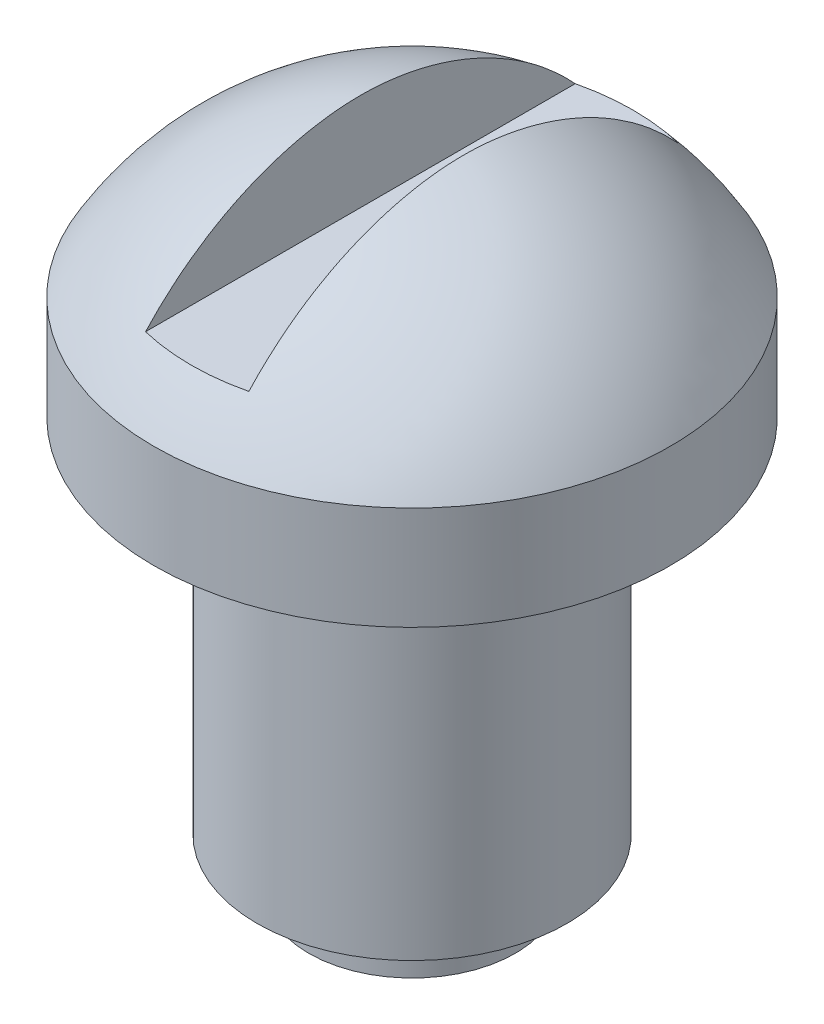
ISO-10303-21;
HEADER;
FILE_DESCRIPTION(('STEP AP214'),'2;1');
FILE_NAME('part.step','',(''),(''),'','','');
FILE_SCHEMA(('AUTOMOTIVE_DESIGN { 1 0 10303 214 1 1 1 1 }'));
ENDSEC;
DATA;
#1=APPLICATION_CONTEXT('core data for automotive mechanical design processes');
#2=APPLICATION_PROTOCOL_DEFINITION('international standard','automotive_design',2000,#1);
#3=PRODUCT_CONTEXT('',#1,'mechanical');
#4=PRODUCT('Part','Part','',(#3));
#5=PRODUCT_RELATED_PRODUCT_CATEGORY('part','',(#4));
#6=PRODUCT_DEFINITION_FORMATION('','',#4);
#7=PRODUCT_DEFINITION_CONTEXT('part definition',#1,'design');
#8=PRODUCT_DEFINITION('design','',#6,#7);
#9=PRODUCT_DEFINITION_SHAPE('','',#8);
#10=(LENGTH_UNIT() NAMED_UNIT(*) SI_UNIT(.MILLI.,.METRE.));
#11=(NAMED_UNIT(*) PLANE_ANGLE_UNIT() SI_UNIT($,.RADIAN.));
#12=(NAMED_UNIT(*) SI_UNIT($,.STERADIAN.) SOLID_ANGLE_UNIT());
#13=UNCERTAINTY_MEASURE_WITH_UNIT(LENGTH_MEASURE(1.E-05),#10,'distance_accuracy_value','');
#14=(GEOMETRIC_REPRESENTATION_CONTEXT(3) GLOBAL_UNCERTAINTY_ASSIGNED_CONTEXT((#13)) GLOBAL_UNIT_ASSIGNED_CONTEXT((#10,
#11,#12)) REPRESENTATION_CONTEXT('',''));
#15=CARTESIAN_POINT('',(0.,0.,0.));
#16=DIRECTION('',(0.,0.,1.));
#17=DIRECTION('',(1.,0.,0.));
#18=AXIS2_PLACEMENT_3D('',#15,#16,#17);
#19=CARTESIAN_POINT('',(1.59397495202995E-09,7.00326915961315,0.));
#20=DIRECTION('',(0.,1.,0.));
#21=DIRECTION('',(0.,0.,1.));
#22=AXIS2_PLACEMENT_3D('',#19,#20,#21);
#23=DEGENERATE_TOROIDAL_SURFACE('',#22,0.198038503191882,6.,.F.);
#24=CARTESIAN_POINT('',(1.59397495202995E-09,10.9999999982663,0.));
#25=DIRECTION('',(0.,-1.,0.));
#26=DIRECTION('',(0.,0.,-1.));
#27=AXIS2_PLACEMENT_3D('',#24,#25,#26);
#28=CIRCLE('',#27,4.27701932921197);
#29=CARTESIAN_POINT('',(-0.999999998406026,10.9999999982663,-4.15847259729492));
#30=VERTEX_POINT('',#29);
#31=CARTESIAN_POINT('',(1.00000000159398,10.9999999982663,-4.15847259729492));
#32=VERTEX_POINT('',#31);
#33=EDGE_CURVE('E68',#30,#32,#28,.T.);
#34=ORIENTED_EDGE('',*,*,#33,.T.);
#35=CARTESIAN_POINT('',(1.00000000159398,12.8824445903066,0.));
#36=CARTESIAN_POINT('',(1.00000000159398,12.8824444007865,0.0847152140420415));
#37=CARTESIAN_POINT('',(1.00000000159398,12.8802443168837,0.169431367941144));
#38=CARTESIAN_POINT('',(1.00000000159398,12.8715212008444,0.33863564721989));
#39=CARTESIAN_POINT('',(1.00000000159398,12.864997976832,0.423123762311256));
#40=CARTESIAN_POINT('',(1.00000000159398,12.8392041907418,0.676049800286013));
#41=CARTESIAN_POINT('',(1.00000000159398,12.8137097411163,0.843886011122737));
#42=CARTESIAN_POINT('',(1.00000000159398,12.7493007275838,1.16718626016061));
#43=CARTESIAN_POINT('',(1.00000000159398,12.7112135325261,1.32281841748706));
#44=CARTESIAN_POINT('',(1.00000000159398,12.622126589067,1.630368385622));
#45=CARTESIAN_POINT('',(1.00000000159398,12.5711218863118,1.78228474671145));
#46=CARTESIAN_POINT('',(1.00000000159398,12.3993728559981,2.23126062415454));
#47=CARTESIAN_POINT('',(1.00000000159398,12.2599232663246,2.52140116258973));
#48=CARTESIAN_POINT('',(1.00000000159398,11.9339477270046,3.07783725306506));
#49=CARTESIAN_POINT('',(1.00000000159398,11.74693953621,3.3438481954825));
#50=CARTESIAN_POINT('',(1.00000000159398,11.3318605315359,3.84147886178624));
#51=CARTESIAN_POINT('',(1.00000000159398,11.1038069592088,4.0731129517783));
#52=CARTESIAN_POINT('',(1.00000000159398,10.6073283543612,4.50058698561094));
#53=CARTESIAN_POINT('',(1.00000000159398,10.3381163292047,4.69551335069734));
#54=CARTESIAN_POINT('',(1.00000000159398,9.7707977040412,5.03757140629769));
#55=CARTESIAN_POINT('',(1.00000000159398,9.47268567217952,5.18469408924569));
#56=CARTESIAN_POINT('',(1.00000000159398,8.85530329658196,5.42727476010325));
#57=CARTESIAN_POINT('',(1.00000000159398,8.53598121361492,5.52260078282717));
#58=CARTESIAN_POINT('',(1.00000000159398,7.88570514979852,5.65830273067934));
#59=CARTESIAN_POINT('',(1.00000000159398,7.55475170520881,5.69868118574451));
#60=CARTESIAN_POINT('',(1.00000000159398,7.0569891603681,5.71723650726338));
#61=CARTESIAN_POINT('',(1.00000000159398,6.89070763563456,5.71640136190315));
#62=CARTESIAN_POINT('',(1.00000000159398,6.55882164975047,5.70073557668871));
#63=CARTESIAN_POINT('',(1.00000000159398,6.39321696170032,5.68591009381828));
#64=CARTESIAN_POINT('',(1.00000000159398,6.06378661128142,5.64235342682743));
#65=CARTESIAN_POINT('',(1.00000000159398,5.89996173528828,5.61361633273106));
#66=CARTESIAN_POINT('',(1.00000000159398,5.57537265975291,5.54245436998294));
#67=CARTESIAN_POINT('',(1.00000000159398,5.41460735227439,5.50003456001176));
#68=CARTESIAN_POINT('',(1.00000000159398,5.09714777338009,5.40178062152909));
#69=CARTESIAN_POINT('',(1.00000000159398,4.94045544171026,5.34594022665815));
#70=CARTESIAN_POINT('',(1.00000000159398,4.6323914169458,5.22127480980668));
#71=CARTESIAN_POINT('',(1.00000000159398,4.4810177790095,5.15245459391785));
#72=CARTESIAN_POINT('',(1.00000000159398,4.1845729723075,5.00228575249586));
#73=CARTESIAN_POINT('',(1.00000000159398,4.03950329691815,4.9209341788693));
#74=CARTESIAN_POINT('',(1.00000000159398,3.75679081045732,4.7463232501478));
#75=CARTESIAN_POINT('',(1.00000000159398,3.61914526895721,4.65306831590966));
#76=CARTESIAN_POINT('',(1.00000000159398,3.35221521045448,4.45529471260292));
#77=CARTESIAN_POINT('',(1.00000000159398,3.22293005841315,4.35077690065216));
#78=CARTESIAN_POINT('',(1.00000000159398,2.97368009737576,4.13125199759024));
#79=CARTESIAN_POINT('',(1.00000000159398,2.85371184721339,4.01624881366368));
#80=CARTESIAN_POINT('',(1.00000000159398,2.62382717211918,3.7764534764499));
#81=CARTESIAN_POINT('',(1.00000000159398,2.51391744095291,3.65165490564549));
#82=CARTESIAN_POINT('',(1.00000000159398,2.3050737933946,3.39326595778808));
#83=CARTESIAN_POINT('',(1.00000000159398,2.20613578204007,3.25967889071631));
#84=CARTESIAN_POINT('',(1.00000000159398,2.02003412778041,2.98479173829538));
#85=CARTESIAN_POINT('',(1.00000000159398,1.93285544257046,2.8435018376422));
#86=CARTESIAN_POINT('',(1.00000000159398,1.77080927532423,2.55409979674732));
#87=CARTESIAN_POINT('',(1.00000000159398,1.69593708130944,2.4059902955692));
#88=CARTESIAN_POINT('',(1.00000000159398,1.55905222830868,2.10391433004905));
#89=CARTESIAN_POINT('',(1.00000000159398,1.49704151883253,1.94994698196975));
#90=CARTESIAN_POINT('',(1.00000000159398,1.38646037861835,1.63722122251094));
#91=CARTESIAN_POINT('',(1.00000000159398,1.33789225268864,1.47846199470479));
#92=CARTESIAN_POINT('',(1.00000000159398,1.25519800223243,1.15867481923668));
#93=CARTESIAN_POINT('',(1.00000000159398,1.22095170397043,0.997677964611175));
#94=CARTESIAN_POINT('',(1.00000000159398,1.16720809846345,0.673232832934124));
#95=CARTESIAN_POINT('',(1.00000000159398,1.14770610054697,0.509785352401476));
#96=CARTESIAN_POINT('',(1.00000000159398,1.13050305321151,0.26390234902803));
#97=CARTESIAN_POINT('',(1.00000000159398,1.12677602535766,0.18185887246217));
#98=CARTESIAN_POINT('',(1.00000000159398,1.12343933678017,0.0176888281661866));
#99=CARTESIAN_POINT('',(1.00000000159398,1.12382963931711,-0.0644377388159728));
#100=CARTESIAN_POINT('',(1.00000000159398,1.13117783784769,-0.310631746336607));
#101=CARTESIAN_POINT('',(1.00000000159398,1.14431037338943,-0.474551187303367));
#102=CARTESIAN_POINT('',(1.00000000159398,1.18344980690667,-0.781882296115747));
#103=CARTESIAN_POINT('',(1.00000000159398,1.20782746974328,-0.925511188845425));
#104=CARTESIAN_POINT('',(1.00000000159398,1.26775213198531,-1.21041404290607));
#105=CARTESIAN_POINT('',(1.00000000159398,1.30329866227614,-1.35168810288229));
#106=CARTESIAN_POINT('',(1.00000000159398,1.38511184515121,-1.63129077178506));
#107=CARTESIAN_POINT('',(1.00000000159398,1.43139251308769,-1.769615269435));
#108=CARTESIAN_POINT('',(1.00000000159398,1.5342345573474,-2.04238346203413));
#109=CARTESIAN_POINT('',(1.00000000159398,1.59079595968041,-2.17682714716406));
#110=CARTESIAN_POINT('',(1.00000000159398,1.71932361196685,-2.45295167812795));
#111=CARTESIAN_POINT('',(1.00000000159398,1.79221580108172,-2.59420244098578));
#112=CARTESIAN_POINT('',(1.00000000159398,1.94924069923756,-2.87037584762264));
#113=CARTESIAN_POINT('',(1.00000000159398,2.03337758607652,-3.00529611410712));
#114=CARTESIAN_POINT('',(1.00000000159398,2.21221225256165,-3.26776765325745));
#115=CARTESIAN_POINT('',(1.00000000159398,2.30690040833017,-3.39532548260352));
#116=CARTESIAN_POINT('',(1.00000000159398,2.50630018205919,-3.64242532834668));
#117=CARTESIAN_POINT('',(1.00000000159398,2.61101549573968,-3.76196436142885));
#118=CARTESIAN_POINT('',(1.00000000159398,2.83416038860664,-3.99684693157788));
#119=CARTESIAN_POINT('',(1.00000000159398,2.95297255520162,-4.11182732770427));
#120=CARTESIAN_POINT('',(1.00000000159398,3.19986737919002,-4.33145883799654));
#121=CARTESIAN_POINT('',(1.00000000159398,3.32795355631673,-4.43610599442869));
#122=CARTESIAN_POINT('',(1.00000000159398,3.59245187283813,-4.63429076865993));
#123=CARTESIAN_POINT('',(1.00000000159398,3.72886406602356,-4.72782831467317));
#124=CARTESIAN_POINT('',(1.00000000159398,4.00910184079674,-4.90316978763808));
#125=CARTESIAN_POINT('',(1.00000000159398,4.1529301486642,-4.98496935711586));
#126=CARTESIAN_POINT('',(1.00000000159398,4.44750752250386,-5.13651256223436));
#127=CARTESIAN_POINT('',(1.00000000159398,4.59828117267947,-5.20620841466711));
#128=CARTESIAN_POINT('',(1.00000000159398,4.90521575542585,-5.33268683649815));
#129=CARTESIAN_POINT('',(1.00000000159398,5.06137865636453,-5.38946462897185));
#130=CARTESIAN_POINT('',(1.00000000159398,5.37785718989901,-5.48964948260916));
#131=CARTESIAN_POINT('',(1.00000000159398,5.5381708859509,-5.53306266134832));
#132=CARTESIAN_POINT('',(1.00000000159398,5.86193882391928,-5.60625938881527));
#133=CARTESIAN_POINT('',(1.00000000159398,6.0253941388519,-5.63603819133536));
#134=CARTESIAN_POINT('',(1.00000000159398,6.3543587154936,-5.68175099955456));
#135=CARTESIAN_POINT('',(1.00000000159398,6.51986947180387,-5.69767425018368));
#136=CARTESIAN_POINT('',(1.00000000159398,6.85164404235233,-5.71552388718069));
#137=CARTESIAN_POINT('',(1.00000000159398,7.0179078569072,-5.71745026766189));
#138=CARTESIAN_POINT('',(1.00000000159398,7.3500389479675,-5.70729151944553));
#139=CARTESIAN_POINT('',(1.00000000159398,7.51590614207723,-5.69520369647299));
#140=CARTESIAN_POINT('',(1.00000000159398,7.84597510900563,-5.65710445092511));
#141=CARTESIAN_POINT('',(1.00000000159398,8.01017744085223,-5.63109787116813));
#142=CARTESIAN_POINT('',(1.00000000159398,8.33588954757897,-5.5653319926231));
#143=CARTESIAN_POINT('',(1.00000000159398,8.49739794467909,-5.52556586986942));
#144=CARTESIAN_POINT('',(1.00000000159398,8.81643061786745,-5.4325826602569));
#145=CARTESIAN_POINT('',(1.00000000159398,8.97395633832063,-5.379370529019));
#146=CARTESIAN_POINT('',(1.00000000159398,9.28403226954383,-5.25983909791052));
#147=CARTESIAN_POINT('',(1.00000000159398,9.43658029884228,-5.19351413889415));
#148=CARTESIAN_POINT('',(1.00000000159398,9.73548754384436,-5.04826866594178));
#149=CARTESIAN_POINT('',(1.00000000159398,9.88184902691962,-4.96935281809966));
#150=CARTESIAN_POINT('',(1.00000000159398,10.167439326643,-4.79944382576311));
#151=CARTESIAN_POINT('',(1.00000000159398,10.3066661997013,-4.70844741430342));
#152=CARTESIAN_POINT('',(1.00000000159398,10.5769008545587,-4.5150743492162));
#153=CARTESIAN_POINT('',(1.00000000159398,10.7079116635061,-4.41270192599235));
#154=CARTESIAN_POINT('',(1.00000000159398,10.9608430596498,-4.19726618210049));
#155=CARTESIAN_POINT('',(1.00000000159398,11.0827630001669,-4.08420210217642));
#156=CARTESIAN_POINT('',(1.00000000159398,11.3165839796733,-3.8482330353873));
#157=CARTESIAN_POINT('',(1.00000000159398,11.4284887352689,-3.72533173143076));
#158=CARTESIAN_POINT('',(1.00000000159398,11.6414066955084,-3.4706586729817));
#159=CARTESIAN_POINT('',(1.00000000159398,11.7424316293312,-3.33889672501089));
#160=CARTESIAN_POINT('',(1.00000000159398,11.9329571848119,-3.06736210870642));
#161=CARTESIAN_POINT('',(1.00000000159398,12.0224621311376,-2.92759247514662));
#162=CARTESIAN_POINT('',(1.00000000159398,12.1894449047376,-2.64077164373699));
#163=CARTESIAN_POINT('',(1.00000000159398,12.2669051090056,-2.49371018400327));
#164=CARTESIAN_POINT('',(1.00000000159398,12.4090278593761,-2.19353250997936));
#165=CARTESIAN_POINT('',(1.00000000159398,12.4736909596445,-2.04041655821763));
#166=CARTESIAN_POINT('',(1.00000000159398,12.587826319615,-1.73407724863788));
#167=CARTESIAN_POINT('',(1.00000000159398,12.6377111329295,-1.58100763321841));
#168=CARTESIAN_POINT('',(1.00000000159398,12.7243849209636,-1.27117461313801));
#169=CARTESIAN_POINT('',(1.00000000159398,12.7611717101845,-1.11441059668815));
#170=CARTESIAN_POINT('',(1.00000000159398,12.8208024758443,-0.798698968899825));
#171=CARTESIAN_POINT('',(1.00000000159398,12.8436887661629,-0.639759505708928));
#172=CARTESIAN_POINT('',(1.00000000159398,12.8668198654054,-0.400349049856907));
#173=CARTESIAN_POINT('',(1.00000000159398,12.8726638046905,-0.32039092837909));
#174=CARTESIAN_POINT('',(1.00000000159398,12.8804760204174,-0.1602888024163));
#175=CARTESIAN_POINT('',(1.00000000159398,12.8824447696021,-0.0801448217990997));
#176=CARTESIAN_POINT('',(1.00000000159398,12.8824445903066,0.));
#177=B_SPLINE_CURVE_WITH_KNOTS('',3,(#35,#36,#37,#38,#39,#40,#41,#42,#43,#44,#45,#46,#47,#48,
#49,#50,#51,#52,#53,#54,#55,#56,#57,#58,#59,#60,#61,#62,#63,#64,#65,#66,#67,#68,#69,#70,#71,#72,
#73,#74,#75,#76,#77,#78,#79,#80,#81,#82,#83,#84,#85,#86,#87,#88,#89,#90,#91,#92,#93,#94,#95,#96,
#97,#98,#99,#100,#101,#102,#103,#104,#105,#106,#107,#108,#109,#110,#111,#112,#113,#114,#115,
#116,#117,#118,#119,#120,#121,#122,#123,#124,#125,#126,#127,#128,#129,#130,#131,#132,#133,#134,
#135,#136,#137,#138,#139,#140,#141,#142,#143,#144,#145,#146,#147,#148,#149,#150,#151,#152,#153,
#154,#155,#156,#157,#158,#159,#160,#161,#162,#163,#164,#165,#166,#167,#168,#169,#170,#171,#172,
#173,#174,#175,#176),.UNSPECIFIED.,.T.,.F.,(4,2,2,2,2,2,2,2,2,2,2,2,2,2,2,2,2,2,2,2,2,2,2,2,2,2,
2,2,2,2,2,2,2,2,2,2,2,2,2,2,2,2,2,2,2,2,2,2,2,2,2,2,2,2,2,2,2,2,2,2,2,2,2,2,2,2,2,2,2,2,4),(0.,
0.254116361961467,0.508244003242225,1.01668865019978,1.49678878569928,1.9770733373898,
2.93808324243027,3.90925590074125,4.88002155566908,5.87243907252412,6.86504348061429,
7.86016508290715,8.85524086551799,9.35360700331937,9.8517895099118,10.3501838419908,
10.8483941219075,11.3468374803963,11.845096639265,12.3434731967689,12.8416651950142,
13.3398193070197,13.8377885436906,14.3360867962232,14.8341984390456,15.3316667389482,
15.8289441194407,16.3262968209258,16.8237347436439,17.3169106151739,17.8099295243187,
18.0562229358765,18.3025141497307,18.7949837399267,19.2315947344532,19.6681873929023,
20.1053533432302,20.5425203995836,21.0188367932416,21.495330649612,21.9713933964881,
22.4476322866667,22.9430608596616,23.4386784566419,23.9342992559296,24.4301035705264,
24.927822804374,25.425725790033,25.9234005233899,26.421248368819,26.9194823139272,
27.4177164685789,27.9160464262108,28.4142031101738,28.9126072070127,29.4108278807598,
29.9092640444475,30.4075159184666,30.9059028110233,31.4041049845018,31.902342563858,
32.4003944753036,32.8979039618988,33.395226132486,33.8932692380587,34.3912907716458,
34.8737050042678,35.3561996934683,35.8372181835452,36.0776542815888,36.3180610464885),.UNSPECIFIED.);
#178=CARTESIAN_POINT('',(1.00000000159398,10.9999999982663,4.15847259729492));
#179=VERTEX_POINT('',#178);
#180=EDGE_CURVE('E11',#32,#179,#177,.T.);
#181=ORIENTED_EDGE('',*,*,#180,.T.);
#182=CARTESIAN_POINT('',(-0.999999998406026,10.9999999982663,4.15847259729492));
#183=VERTEX_POINT('',#182);
#184=EDGE_CURVE('E45',#179,#183,#28,.T.);
#185=ORIENTED_EDGE('',*,*,#184,.T.);
#186=CARTESIAN_POINT('',(-0.999999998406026,12.8824445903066,0.));
#187=CARTESIAN_POINT('',(-0.999999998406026,12.8824444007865,-0.0847152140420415));
#188=CARTESIAN_POINT('',(-0.999999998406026,12.8802443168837,-0.169431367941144));
#189=CARTESIAN_POINT('',(-0.999999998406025,12.8715212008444,-0.33863564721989));
#190=CARTESIAN_POINT('',(-0.999999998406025,12.864997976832,-0.423123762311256));
#191=CARTESIAN_POINT('',(-0.999999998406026,12.8392041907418,-0.676049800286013));
#192=CARTESIAN_POINT('',(-0.999999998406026,12.8137097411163,-0.843886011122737));
#193=CARTESIAN_POINT('',(-0.999999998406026,12.7493007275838,-1.16718626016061));
#194=CARTESIAN_POINT('',(-0.999999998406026,12.7112135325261,-1.32281841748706));
#195=CARTESIAN_POINT('',(-0.999999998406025,12.622126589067,-1.630368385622));
#196=CARTESIAN_POINT('',(-0.999999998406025,12.5711218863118,-1.78228474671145));
#197=CARTESIAN_POINT('',(-0.999999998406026,12.3993728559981,-2.23126062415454));
#198=CARTESIAN_POINT('',(-0.999999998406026,12.2599232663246,-2.52140116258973));
#199=CARTESIAN_POINT('',(-0.999999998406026,11.9339477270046,-3.07783725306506));
#200=CARTESIAN_POINT('',(-0.999999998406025,11.74693953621,-3.3438481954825));
#201=CARTESIAN_POINT('',(-0.999999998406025,11.3318605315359,-3.84147886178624));
#202=CARTESIAN_POINT('',(-0.999999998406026,11.1038069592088,-4.0731129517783));
#203=CARTESIAN_POINT('',(-0.999999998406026,10.6073283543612,-4.50058698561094));
#204=CARTESIAN_POINT('',(-0.999999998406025,10.3381163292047,-4.69551335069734));
#205=CARTESIAN_POINT('',(-0.999999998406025,9.7707977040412,-5.03757140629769));
#206=CARTESIAN_POINT('',(-0.999999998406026,9.47268567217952,-5.18469408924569));
#207=CARTESIAN_POINT('',(-0.999999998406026,8.85530329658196,-5.42727476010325));
#208=CARTESIAN_POINT('',(-0.999999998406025,8.53598121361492,-5.52260078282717));
#209=CARTESIAN_POINT('',(-0.999999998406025,7.88570514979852,-5.65830273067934));
#210=CARTESIAN_POINT('',(-0.999999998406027,7.55475170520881,-5.69868118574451));
#211=CARTESIAN_POINT('',(-0.999999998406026,7.0569891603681,-5.71723650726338));
#212=CARTESIAN_POINT('',(-0.999999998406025,6.89070763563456,-5.71640136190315));
#213=CARTESIAN_POINT('',(-0.999999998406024,6.55882164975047,-5.70073557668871));
#214=CARTESIAN_POINT('',(-0.999999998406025,6.39321696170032,-5.68591009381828));
#215=CARTESIAN_POINT('',(-0.999999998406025,6.06378661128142,-5.64235342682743));
#216=CARTESIAN_POINT('',(-0.999999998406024,5.89996173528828,-5.61361633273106));
#217=CARTESIAN_POINT('',(-0.999999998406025,5.57537265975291,-5.54245436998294));
#218=CARTESIAN_POINT('',(-0.999999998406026,5.41460735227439,-5.50003456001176));
#219=CARTESIAN_POINT('',(-0.999999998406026,5.09714777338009,-5.40178062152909));
#220=CARTESIAN_POINT('',(-0.999999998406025,4.94045544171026,-5.34594022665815));
#221=CARTESIAN_POINT('',(-0.999999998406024,4.6323914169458,-5.22127480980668));
#222=CARTESIAN_POINT('',(-0.999999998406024,4.4810177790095,-5.15245459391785));
#223=CARTESIAN_POINT('',(-0.999999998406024,4.1845729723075,-5.00228575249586));
#224=CARTESIAN_POINT('',(-0.999999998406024,4.03950329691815,-4.9209341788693));
#225=CARTESIAN_POINT('',(-0.999999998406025,3.75679081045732,-4.74632325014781));
#226=CARTESIAN_POINT('',(-0.999999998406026,3.61914526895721,-4.65306831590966));
#227=CARTESIAN_POINT('',(-0.999999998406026,3.35221521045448,-4.45529471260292));
#228=CARTESIAN_POINT('',(-0.999999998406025,3.22293005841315,-4.35077690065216));
#229=CARTESIAN_POINT('',(-0.999999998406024,2.97368009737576,-4.13125199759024));
#230=CARTESIAN_POINT('',(-0.999999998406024,2.85371184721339,-4.01624881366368));
#231=CARTESIAN_POINT('',(-0.999999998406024,2.62382717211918,-3.7764534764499));
#232=CARTESIAN_POINT('',(-0.999999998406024,2.51391744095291,-3.65165490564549));
#233=CARTESIAN_POINT('',(-0.999999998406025,2.3050737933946,-3.39326595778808));
#234=CARTESIAN_POINT('',(-0.999999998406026,2.20613578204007,-3.25967889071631));
#235=CARTESIAN_POINT('',(-0.999999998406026,2.02003412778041,-2.98479173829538));
#236=CARTESIAN_POINT('',(-0.999999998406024,1.93285544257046,-2.8435018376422));
#237=CARTESIAN_POINT('',(-0.999999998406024,1.77080927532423,-2.55409979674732));
#238=CARTESIAN_POINT('',(-0.999999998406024,1.69593708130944,-2.4059902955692));
#239=CARTESIAN_POINT('',(-0.999999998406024,1.55905222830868,-2.10391433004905));
#240=CARTESIAN_POINT('',(-0.999999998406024,1.49704151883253,-1.94994698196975));
#241=CARTESIAN_POINT('',(-0.999999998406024,1.38646037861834,-1.63722122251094));
#242=CARTESIAN_POINT('',(-0.999999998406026,1.33789225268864,-1.47846199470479));
#243=CARTESIAN_POINT('',(-0.999999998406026,1.25519800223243,-1.15867481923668));
#244=CARTESIAN_POINT('',(-0.999999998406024,1.22095170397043,-0.997677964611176));
#245=CARTESIAN_POINT('',(-0.999999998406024,1.16720809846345,-0.673232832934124));
#246=CARTESIAN_POINT('',(-0.999999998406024,1.14770610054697,-0.509785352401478));
#247=CARTESIAN_POINT('',(-0.999999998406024,1.13050305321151,-0.263902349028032));
#248=CARTESIAN_POINT('',(-0.999999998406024,1.12677602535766,-0.181858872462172));
#249=CARTESIAN_POINT('',(-0.999999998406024,1.12343933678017,-0.0176888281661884));
#250=CARTESIAN_POINT('',(-0.999999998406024,1.12382963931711,0.0644377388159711));
#251=CARTESIAN_POINT('',(-0.999999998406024,1.13117783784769,0.310631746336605));
#252=CARTESIAN_POINT('',(-0.999999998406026,1.14431037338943,0.474551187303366));
#253=CARTESIAN_POINT('',(-0.999999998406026,1.18344980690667,0.781882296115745));
#254=CARTESIAN_POINT('',(-0.999999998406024,1.20782746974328,0.925511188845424));
#255=CARTESIAN_POINT('',(-0.999999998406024,1.26775213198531,1.21041404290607));
#256=CARTESIAN_POINT('',(-0.999999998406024,1.30329866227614,1.35168810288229));
#257=CARTESIAN_POINT('',(-0.999999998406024,1.38511184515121,1.63129077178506));
#258=CARTESIAN_POINT('',(-0.999999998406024,1.43139251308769,1.76961526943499));
#259=CARTESIAN_POINT('',(-0.999999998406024,1.5342345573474,2.04238346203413));
#260=CARTESIAN_POINT('',(-0.999999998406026,1.59079595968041,2.17682714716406));
#261=CARTESIAN_POINT('',(-0.999999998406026,1.71932361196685,2.45295167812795));
#262=CARTESIAN_POINT('',(-0.999999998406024,1.79221580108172,2.59420244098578));
#263=CARTESIAN_POINT('',(-0.999999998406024,1.94924069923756,2.87037584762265));
#264=CARTESIAN_POINT('',(-0.999999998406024,2.03337758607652,3.00529611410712));
#265=CARTESIAN_POINT('',(-0.999999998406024,2.21221225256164,3.26776765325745));
#266=CARTESIAN_POINT('',(-0.999999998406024,2.30690040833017,3.39532548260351));
#267=CARTESIAN_POINT('',(-0.999999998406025,2.50630018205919,3.64242532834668));
#268=CARTESIAN_POINT('',(-0.999999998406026,2.61101549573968,3.76196436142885));
#269=CARTESIAN_POINT('',(-0.999999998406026,2.83416038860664,3.99684693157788));
#270=CARTESIAN_POINT('',(-0.999999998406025,2.95297255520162,4.11182732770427));
#271=CARTESIAN_POINT('',(-0.999999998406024,3.19986737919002,4.33145883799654));
#272=CARTESIAN_POINT('',(-0.999999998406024,3.32795355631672,4.43610599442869));
#273=CARTESIAN_POINT('',(-0.999999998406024,3.59245187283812,4.63429076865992));
#274=CARTESIAN_POINT('',(-0.999999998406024,3.72886406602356,4.72782831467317));
#275=CARTESIAN_POINT('',(-0.999999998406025,4.00910184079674,4.90316978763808));
#276=CARTESIAN_POINT('',(-0.999999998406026,4.1529301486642,4.98496935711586));
#277=CARTESIAN_POINT('',(-0.999999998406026,4.44750752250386,5.13651256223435));
#278=CARTESIAN_POINT('',(-0.999999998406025,4.59828117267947,5.20620841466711));
#279=CARTESIAN_POINT('',(-0.999999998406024,4.90521575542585,5.33268683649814));
#280=CARTESIAN_POINT('',(-0.999999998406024,5.06137865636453,5.38946462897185));
#281=CARTESIAN_POINT('',(-0.999999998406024,5.37785718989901,5.48964948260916));
#282=CARTESIAN_POINT('',(-0.999999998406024,5.5381708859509,5.53306266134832));
#283=CARTESIAN_POINT('',(-0.999999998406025,5.86193882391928,5.60625938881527));
#284=CARTESIAN_POINT('',(-0.999999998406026,6.0253941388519,5.63603819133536));
#285=CARTESIAN_POINT('',(-0.999999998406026,6.3543587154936,5.68175099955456));
#286=CARTESIAN_POINT('',(-0.999999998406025,6.51986947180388,5.69767425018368));
#287=CARTESIAN_POINT('',(-0.999999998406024,6.85164404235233,5.71552388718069));
#288=CARTESIAN_POINT('',(-0.999999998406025,7.0179078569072,5.71745026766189));
#289=CARTESIAN_POINT('',(-0.999999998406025,7.3500389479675,5.70729151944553));
#290=CARTESIAN_POINT('',(-0.999999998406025,7.51590614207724,5.69520369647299));
#291=CARTESIAN_POINT('',(-0.999999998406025,7.84597510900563,5.65710445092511));
#292=CARTESIAN_POINT('',(-0.999999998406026,8.01017744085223,5.63109787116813));
#293=CARTESIAN_POINT('',(-0.999999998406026,8.33588954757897,5.56533199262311));
#294=CARTESIAN_POINT('',(-0.999999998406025,8.49739794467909,5.52556586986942));
#295=CARTESIAN_POINT('',(-0.999999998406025,8.81643061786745,5.4325826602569));
#296=CARTESIAN_POINT('',(-0.999999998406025,8.97395633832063,5.379370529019));
#297=CARTESIAN_POINT('',(-0.999999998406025,9.28403226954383,5.25983909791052));
#298=CARTESIAN_POINT('',(-0.999999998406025,9.43658029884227,5.19351413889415));
#299=CARTESIAN_POINT('',(-0.999999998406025,9.73548754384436,5.04826866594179));
#300=CARTESIAN_POINT('',(-0.999999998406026,9.88184902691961,4.96935281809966));
#301=CARTESIAN_POINT('',(-0.999999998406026,10.167439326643,4.79944382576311));
#302=CARTESIAN_POINT('',(-0.999999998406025,10.3066661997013,4.70844741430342));
#303=CARTESIAN_POINT('',(-0.999999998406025,10.5769008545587,4.5150743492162));
#304=CARTESIAN_POINT('',(-0.999999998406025,10.7079116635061,4.41270192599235));
#305=CARTESIAN_POINT('',(-0.999999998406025,10.9608430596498,4.19726618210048));
#306=CARTESIAN_POINT('',(-0.999999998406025,11.0827630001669,4.08420210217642));
#307=CARTESIAN_POINT('',(-0.999999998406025,11.3165839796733,3.8482330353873));
#308=CARTESIAN_POINT('',(-0.999999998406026,11.4284887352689,3.72533173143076));
#309=CARTESIAN_POINT('',(-0.999999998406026,11.6414066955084,3.4706586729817));
#310=CARTESIAN_POINT('',(-0.999999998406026,11.7424316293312,3.33889672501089));
#311=CARTESIAN_POINT('',(-0.999999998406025,11.9329571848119,3.06736210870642));
#312=CARTESIAN_POINT('',(-0.999999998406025,12.0224621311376,2.92759247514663));
#313=CARTESIAN_POINT('',(-0.999999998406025,12.1894449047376,2.64077164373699));
#314=CARTESIAN_POINT('',(-0.999999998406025,12.2669051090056,2.49371018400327));
#315=CARTESIAN_POINT('',(-0.999999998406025,12.4090278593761,2.19353250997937));
#316=CARTESIAN_POINT('',(-0.999999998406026,12.4736909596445,2.04041655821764));
#317=CARTESIAN_POINT('',(-0.999999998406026,12.587826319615,1.73407724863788));
#318=CARTESIAN_POINT('',(-0.999999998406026,12.6377111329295,1.58100763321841));
#319=CARTESIAN_POINT('',(-0.999999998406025,12.7243849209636,1.27117461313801));
#320=CARTESIAN_POINT('',(-0.999999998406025,12.7611717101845,1.11441059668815));
#321=CARTESIAN_POINT('',(-0.999999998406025,12.8208024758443,0.798698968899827));
#322=CARTESIAN_POINT('',(-0.999999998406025,12.8436887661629,0.639759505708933));
#323=CARTESIAN_POINT('',(-0.999999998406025,12.8668198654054,0.400349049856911));
#324=CARTESIAN_POINT('',(-0.999999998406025,12.8726638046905,0.320390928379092));
#325=CARTESIAN_POINT('',(-0.999999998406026,12.8804760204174,0.1602888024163));
#326=CARTESIAN_POINT('',(-0.999999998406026,12.8824447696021,0.0801448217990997));
#327=CARTESIAN_POINT('',(-0.999999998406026,12.8824445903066,0.));
#328=B_SPLINE_CURVE_WITH_KNOTS('',3,(#186,#187,#188,#189,#190,#191,#192,#193,#194,#195,#196,
#197,#198,#199,#200,#201,#202,#203,#204,#205,#206,#207,#208,#209,#210,#211,#212,#213,#214,#215,
#216,#217,#218,#219,#220,#221,#222,#223,#224,#225,#226,#227,#228,#229,#230,#231,#232,#233,#234,
#235,#236,#237,#238,#239,#240,#241,#242,#243,#244,#245,#246,#247,#248,#249,#250,#251,#252,#253,
#254,#255,#256,#257,#258,#259,#260,#261,#262,#263,#264,#265,#266,#267,#268,#269,#270,#271,#272,
#273,#274,#275,#276,#277,#278,#279,#280,#281,#282,#283,#284,#285,#286,#287,#288,#289,#290,#291,
#292,#293,#294,#295,#296,#297,#298,#299,#300,#301,#302,#303,#304,#305,#306,#307,#308,#309,#310,
#311,#312,#313,#314,#315,#316,#317,#318,#319,#320,#321,#322,#323,#324,#325,#326,#327),
.UNSPECIFIED.,.T.,.F.,(4,2,2,2,2,2,2,2,2,2,2,2,2,2,2,2,2,2,2,2,2,2,2,2,2,2,2,2,2,2,2,2,2,2,2,2,
2,2,2,2,2,2,2,2,2,2,2,2,2,2,2,2,2,2,2,2,2,2,2,2,2,2,2,2,2,2,2,2,2,2,4),(0.,0.254116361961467,
0.508244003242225,1.01668865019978,1.49678878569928,1.9770733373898,2.93808324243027,
3.90925590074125,4.88002155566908,5.87243907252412,6.86504348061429,7.86016508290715,
8.85524086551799,9.35360700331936,9.8517895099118,10.3501838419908,10.8483941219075,
11.3468374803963,11.845096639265,12.3434731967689,12.8416651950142,13.3398193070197,
13.8377885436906,14.3360867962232,14.8341984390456,15.3316667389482,15.8289441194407,
16.3262968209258,16.8237347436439,17.3169106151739,17.8099295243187,18.0562229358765,
18.3025141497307,18.7949837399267,19.2315947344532,19.6681873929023,20.1053533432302,
20.5425203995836,21.0188367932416,21.495330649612,21.9713933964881,22.4476322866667,
22.9430608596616,23.4386784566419,23.9342992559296,24.4301035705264,24.927822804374,
25.425725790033,25.9234005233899,26.421248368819,26.9194823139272,27.4177164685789,
27.9160464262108,28.4142031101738,28.9126072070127,29.4108278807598,29.9092640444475,
30.4075159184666,30.9059028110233,31.4041049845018,31.902342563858,32.4003944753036,
32.8979039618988,33.395226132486,33.8932692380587,34.3912907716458,34.8737050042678,
35.3561996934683,35.8372181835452,36.0776542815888,36.3180610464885),.UNSPECIFIED.);
#329=EDGE_CURVE('E64',#183,#30,#328,.T.);
#330=ORIENTED_EDGE('',*,*,#329,.T.);
#331=EDGE_LOOP('',(#34,#181,#185,#330));
#332=FACE_BOUND('',#331,.T.);
#333=CARTESIAN_POINT('',(1.59397495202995E-09,9.99999999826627,0.));
#334=DIRECTION('',(0.,1.,0.));
#335=DIRECTION('',(0.,0.,1.));
#336=AXIS2_PLACEMENT_3D('',#333,#334,#335);
#337=CIRCLE('',#336,5.);
#338=CARTESIAN_POINT('',(1.59397495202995E-09,9.99999999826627,5.));
#339=VERTEX_POINT('',#338);
#340=EDGE_CURVE('E69',#339,#339,#337,.T.);
#341=ORIENTED_EDGE('',*,*,#340,.T.);
#342=EDGE_LOOP('',(#341));
#343=FACE_BOUND('',#342,.T.);
#344=ADVANCED_FACE('F34',(#332,#343),#23,.F.);
#345=CARTESIAN_POINT('',(1.59397495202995E-09,-1.73372427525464E-09,0.));
#346=DIRECTION('',(0.,1.,0.));
#347=DIRECTION('',(0.,0.,1.));
#348=AXIS2_PLACEMENT_3D('',#345,#346,#347);
#349=CYLINDRICAL_SURFACE('',#348,5.);
#350=ORIENTED_EDGE('',*,*,#340,.F.);
#351=EDGE_LOOP('',(#350));
#352=FACE_BOUND('',#351,.T.);
#353=CARTESIAN_POINT('',(1.59397495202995E-09,7.99999999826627,0.));
#354=DIRECTION('',(0.,1.,0.));
#355=DIRECTION('',(0.,0.,1.));
#356=AXIS2_PLACEMENT_3D('',#353,#354,#355);
#357=CIRCLE('',#356,5.);
#358=CARTESIAN_POINT('',(1.59397495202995E-09,7.99999999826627,5.));
#359=VERTEX_POINT('',#358);
#360=EDGE_CURVE('E118',#359,#359,#357,.T.);
#361=ORIENTED_EDGE('',*,*,#360,.T.);
#362=EDGE_LOOP('',(#361));
#363=FACE_BOUND('',#362,.T.);
#364=ADVANCED_FACE('F106',(#352,#363),#349,.T.);
#365=CARTESIAN_POINT('',(3.00000000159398,7.99999999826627,0.));
#366=DIRECTION('',(0.,1.,0.));
#367=DIRECTION('',(0.,0.,1.));
#368=AXIS2_PLACEMENT_3D('',#365,#366,#367);
#369=PLANE('',#368);
#370=ORIENTED_EDGE('',*,*,#360,.F.);
#371=EDGE_LOOP('',(#370));
#372=FACE_BOUND('',#371,.T.);
#373=CARTESIAN_POINT('',(1.59397495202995E-09,7.99999999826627,0.));
#374=DIRECTION('',(0.,1.,0.));
#375=DIRECTION('',(0.,0.,1.));
#376=AXIS2_PLACEMENT_3D('',#373,#374,#375);
#377=CIRCLE('',#376,3.);
#378=CARTESIAN_POINT('',(1.59397495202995E-09,7.99999999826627,3.));
#379=VERTEX_POINT('',#378);
#380=EDGE_CURVE('E119',#379,#379,#377,.T.);
#381=ORIENTED_EDGE('',*,*,#380,.T.);
#382=EDGE_LOOP('',(#381));
#383=FACE_BOUND('',#382,.T.);
#384=ADVANCED_FACE('F103',(#372,#383),#369,.F.);
#385=CARTESIAN_POINT('',(1.59397495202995E-09,-1.73372427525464E-09,0.));
#386=DIRECTION('',(0.,1.,0.));
#387=DIRECTION('',(0.,0.,1.));
#388=AXIS2_PLACEMENT_3D('',#385,#386,#387);
#389=CYLINDRICAL_SURFACE('',#388,3.);
#390=ORIENTED_EDGE('',*,*,#380,.F.);
#391=EDGE_LOOP('',(#390));
#392=FACE_BOUND('',#391,.T.);
#393=CARTESIAN_POINT('',(1.59397495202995E-09,0.999999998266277,0.));
#394=DIRECTION('',(0.,1.,0.));
#395=DIRECTION('',(0.,0.,1.));
#396=AXIS2_PLACEMENT_3D('',#393,#394,#395);
#397=CIRCLE('',#396,3.);
#398=CARTESIAN_POINT('',(1.59397495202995E-09,0.999999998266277,3.));
#399=VERTEX_POINT('',#398);
#400=EDGE_CURVE('E121',#399,#399,#397,.T.);
#401=ORIENTED_EDGE('',*,*,#400,.T.);
#402=EDGE_LOOP('',(#401));
#403=FACE_BOUND('',#402,.T.);
#404=ADVANCED_FACE('F99',(#392,#403),#389,.T.);
#405=CARTESIAN_POINT('',(2.00000000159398,0.999999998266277,0.));
#406=DIRECTION('',(0.,1.,0.));
#407=DIRECTION('',(0.,0.,1.));
#408=AXIS2_PLACEMENT_3D('',#405,#406,#407);
#409=PLANE('',#408);
#410=ORIENTED_EDGE('',*,*,#400,.F.);
#411=EDGE_LOOP('',(#410));
#412=FACE_BOUND('',#411,.T.);
#413=CARTESIAN_POINT('',(1.59397495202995E-09,0.999999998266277,0.));
#414=DIRECTION('',(0.,1.,0.));
#415=DIRECTION('',(0.,0.,1.));
#416=AXIS2_PLACEMENT_3D('',#413,#414,#415);
#417=CIRCLE('',#416,2.);
#418=CARTESIAN_POINT('',(1.59397495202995E-09,0.999999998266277,2.));
#419=VERTEX_POINT('',#418);
#420=EDGE_CURVE('E126',#419,#419,#417,.T.);
#421=ORIENTED_EDGE('',*,*,#420,.T.);
#422=EDGE_LOOP('',(#421));
#423=FACE_BOUND('',#422,.T.);
#424=ADVANCED_FACE('F95',(#412,#423),#409,.F.);
#425=CARTESIAN_POINT('',(1.59397495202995E-09,-1.73372427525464E-09,0.));
#426=DIRECTION('',(0.,1.,0.));
#427=DIRECTION('',(0.,0.,1.));
#428=AXIS2_PLACEMENT_3D('',#425,#426,#427);
#429=CYLINDRICAL_SURFACE('',#428,2.);
#430=ORIENTED_EDGE('',*,*,#420,.F.);
#431=EDGE_LOOP('',(#430));
#432=FACE_BOUND('',#431,.T.);
#433=CARTESIAN_POINT('',(1.59397495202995E-09,-1.73372427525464E-09,0.));
#434=DIRECTION('',(0.,1.,0.));
#435=DIRECTION('',(0.,0.,1.));
#436=AXIS2_PLACEMENT_3D('',#433,#434,#435);
#437=CIRCLE('',#436,2.);
#438=CARTESIAN_POINT('',(1.59397495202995E-09,-1.73372427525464E-09,2.));
#439=VERTEX_POINT('',#438);
#440=EDGE_CURVE('E129',#439,#439,#437,.T.);
#441=ORIENTED_EDGE('',*,*,#440,.T.);
#442=EDGE_LOOP('',(#441));
#443=FACE_BOUND('',#442,.T.);
#444=ADVANCED_FACE('F91',(#432,#443),#429,.T.);
#445=CARTESIAN_POINT('',(1.59397495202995E-09,-1.73372427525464E-09,0.));
#446=DIRECTION('',(0.,1.,0.));
#447=DIRECTION('',(0.,0.,1.));
#448=AXIS2_PLACEMENT_3D('',#445,#446,#447);
#449=PLANE('',#448);
#450=ORIENTED_EDGE('',*,*,#440,.F.);
#451=EDGE_LOOP('',(#450));
#452=FACE_BOUND('',#451,.T.);
#453=ADVANCED_FACE('F87',(#452),#449,.F.);
#454=CARTESIAN_POINT('',(1.00000000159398,15.9350143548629,-5.));
#455=DIRECTION('',(1.,0.,0.));
#456=DIRECTION('',(0.,1.,0.));
#457=AXIS2_PLACEMENT_3D('',#454,#455,#456);
#458=PLANE('',#457);
#459=DIRECTION('',(0.,0.,1.));
#460=VECTOR('',#459,1.);
#461=CARTESIAN_POINT('',(1.00000000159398,10.9999999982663,-5.));
#462=LINE('',#461,#460);
#463=EDGE_CURVE('E72',#32,#179,#462,.T.);
#464=ORIENTED_EDGE('',*,*,#463,.T.);
#465=ORIENTED_EDGE('',*,*,#180,.F.);
#466=EDGE_LOOP('',(#464,#465));
#467=FACE_BOUND('',#466,.T.);
#468=ADVANCED_FACE('F83',(#467),#458,.F.);
#469=CARTESIAN_POINT('',(-0.999999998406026,10.9999999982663,-5.));
#470=DIRECTION('',(0.,-1.,0.));
#471=DIRECTION('',(0.,0.,-1.));
#472=AXIS2_PLACEMENT_3D('',#469,#470,#471);
#473=PLANE('',#472);
#474=ORIENTED_EDGE('',*,*,#463,.F.);
#475=ORIENTED_EDGE('',*,*,#33,.F.);
#476=DIRECTION('',(0.,0.,1.));
#477=VECTOR('',#476,1.);
#478=CARTESIAN_POINT('',(-0.999999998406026,10.9999999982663,-5.));
#479=LINE('',#478,#477);
#480=EDGE_CURVE('E51',#30,#183,#479,.T.);
#481=ORIENTED_EDGE('',*,*,#480,.T.);
#482=ORIENTED_EDGE('',*,*,#184,.F.);
#483=EDGE_LOOP('',(#474,#475,#481,#482));
#484=FACE_BOUND('',#483,.T.);
#485=ADVANCED_FACE('F71',(#484),#473,.F.);
#486=CARTESIAN_POINT('',(-0.999999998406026,15.9350143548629,-5.));
#487=DIRECTION('',(-1.,0.,0.));
#488=DIRECTION('',(0.,-1.,0.));
#489=AXIS2_PLACEMENT_3D('',#486,#487,#488);
#490=PLANE('',#489);
#491=ORIENTED_EDGE('',*,*,#480,.F.);
#492=ORIENTED_EDGE('',*,*,#329,.F.);
#493=EDGE_LOOP('',(#491,#492));
#494=FACE_BOUND('',#493,.T.);
#495=ADVANCED_FACE('F65',(#494),#490,.F.);
#496=CLOSED_SHELL('',(#344,#364,#384,#404,#424,#444,#453,#468,#485,#495));
#497=MANIFOLD_SOLID_BREP('B2',#496);
#498=ADVANCED_BREP_SHAPE_REPRESENTATION('',(#18,#497),#14);
#499=SHAPE_DEFINITION_REPRESENTATION(#9,#498);
ENDSEC;
END-ISO-10303-21;
